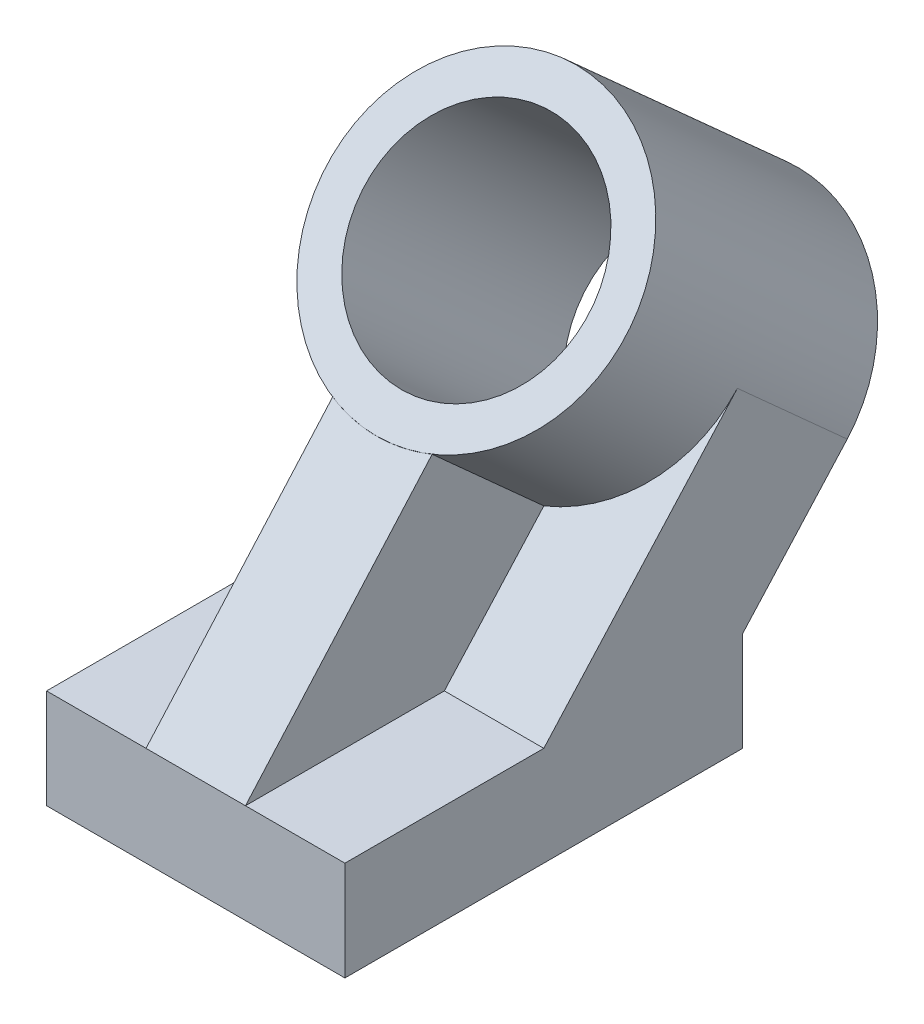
ISO-10303-21;
HEADER;
FILE_DESCRIPTION(('STEP AP214'),'2;1');
FILE_NAME('part.step','',(''),(''),'','','');
FILE_SCHEMA(('AUTOMOTIVE_DESIGN { 1 0 10303 214 1 1 1 1 }'));
ENDSEC;
DATA;
#1=APPLICATION_CONTEXT('core data for automotive mechanical design processes');
#2=APPLICATION_PROTOCOL_DEFINITION('international standard','automotive_design',2000,#1);
#3=PRODUCT_CONTEXT('',#1,'mechanical');
#4=PRODUCT('Part','Part','',(#3));
#5=PRODUCT_RELATED_PRODUCT_CATEGORY('part','',(#4));
#6=PRODUCT_DEFINITION_FORMATION('','',#4);
#7=PRODUCT_DEFINITION_CONTEXT('part definition',#1,'design');
#8=PRODUCT_DEFINITION('design','',#6,#7);
#9=PRODUCT_DEFINITION_SHAPE('','',#8);
#10=(LENGTH_UNIT() NAMED_UNIT(*) SI_UNIT(.MILLI.,.METRE.));
#11=(NAMED_UNIT(*) PLANE_ANGLE_UNIT() SI_UNIT($,.RADIAN.));
#12=(NAMED_UNIT(*) SI_UNIT($,.STERADIAN.) SOLID_ANGLE_UNIT());
#13=UNCERTAINTY_MEASURE_WITH_UNIT(LENGTH_MEASURE(1.E-05),#10,'distance_accuracy_value','');
#14=(GEOMETRIC_REPRESENTATION_CONTEXT(3) GLOBAL_UNCERTAINTY_ASSIGNED_CONTEXT((#13)) GLOBAL_UNIT_ASSIGNED_CONTEXT((#10,
#11,#12)) REPRESENTATION_CONTEXT('',''));
#15=CARTESIAN_POINT('',(0.,0.,0.));
#16=DIRECTION('',(0.,0.,1.));
#17=DIRECTION('',(1.,0.,0.));
#18=AXIS2_PLACEMENT_3D('',#15,#16,#17);
#19=CARTESIAN_POINT('',(38.1,25.4,-50.8));
#20=DIRECTION('',(0.,-0.669130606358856,-0.743144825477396));
#21=DIRECTION('',(0.,0.743144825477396,-0.669130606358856));
#22=AXIS2_PLACEMENT_3D('',#19,#20,#21);
#23=PLANE('',#22);
#24=DIRECTION('',(0.,0.743144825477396,-0.669130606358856));
#25=VECTOR('',#24,1.);
#26=CARTESIAN_POINT('',(12.7,25.4,-50.8));
#27=LINE('',#26,#25);
#28=CARTESIAN_POINT('',(12.7,25.4,-50.8));
#29=VERTEX_POINT('',#28);
#30=CARTESIAN_POINT('',(12.7,53.619218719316,-76.2086986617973));
#31=VERTEX_POINT('',#30);
#32=EDGE_CURVE('E48',#29,#31,#27,.T.);
#33=ORIENTED_EDGE('',*,*,#32,.F.);
#34=DIRECTION('',(-1.,0.,0.));
#35=VECTOR('',#34,1.);
#36=CARTESIAN_POINT('',(38.1,25.4,-50.8));
#37=LINE('',#36,#35);
#38=CARTESIAN_POINT('',(38.1,25.4,-50.8));
#39=VERTEX_POINT('',#38);
#40=EDGE_CURVE('E117',#39,#29,#37,.T.);
#41=ORIENTED_EDGE('',*,*,#40,.F.);
#42=DIRECTION('',(0.,-0.743144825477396,0.669130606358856));
#43=VECTOR('',#42,1.);
#44=CARTESIAN_POINT('',(38.1,25.4,-50.8));
#45=LINE('',#44,#43);
#46=CARTESIAN_POINT('',(38.1,80.313742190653,-100.244555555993));
#47=VERTEX_POINT('',#46);
#48=EDGE_CURVE('E103',#47,#39,#45,.T.);
#49=ORIENTED_EDGE('',*,*,#48,.F.);
#50=CARTESIAN_POINT('',(0.,80.313742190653,-100.244555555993));
#51=DIRECTION('',(0.,-0.669130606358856,-0.743144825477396));
#52=DIRECTION('',(0.,0.743144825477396,-0.669130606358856));
#53=AXIS2_PLACEMENT_3D('',#50,#51,#52);
#54=CIRCLE('',#53,38.1);
#55=EDGE_CURVE('E133',#47,#31,#54,.T.);
#56=ORIENTED_EDGE('',*,*,#55,.T.);
#57=EDGE_LOOP('',(#33,#41,#49,#56));
#58=FACE_BOUND('',#57,.T.);
#59=ADVANCED_FACE('F33',(#58),#23,.F.);
#60=CARTESIAN_POINT('',(38.1,25.4,0.));
#61=DIRECTION('',(0.,-1.,0.));
#62=DIRECTION('',(0.,0.,-1.));
#63=AXIS2_PLACEMENT_3D('',#60,#61,#62);
#64=PLANE('',#63);
#65=DIRECTION('',(0.,0.,-1.));
#66=VECTOR('',#65,1.);
#67=CARTESIAN_POINT('',(12.7,25.4,0.));
#68=LINE('',#67,#66);
#69=CARTESIAN_POINT('',(12.7,25.4,0.));
#70=VERTEX_POINT('',#69);
#71=EDGE_CURVE('E379',#70,#29,#68,.T.);
#72=ORIENTED_EDGE('',*,*,#71,.F.);
#73=DIRECTION('',(-1.,0.,0.));
#74=VECTOR('',#73,1.);
#75=CARTESIAN_POINT('',(38.1,25.4,0.));
#76=LINE('',#75,#74);
#77=CARTESIAN_POINT('',(38.1,25.4,0.));
#78=VERTEX_POINT('',#77);
#79=EDGE_CURVE('E125',#78,#70,#76,.T.);
#80=ORIENTED_EDGE('',*,*,#79,.F.);
#81=DIRECTION('',(0.,0.,1.));
#82=VECTOR('',#81,1.);
#83=CARTESIAN_POINT('',(38.1,25.4,0.));
#84=LINE('',#83,#82);
#85=EDGE_CURVE('E107',#39,#78,#84,.T.);
#86=ORIENTED_EDGE('',*,*,#85,.F.);
#87=ORIENTED_EDGE('',*,*,#40,.T.);
#88=EDGE_LOOP('',(#72,#80,#86,#87));
#89=FACE_BOUND('',#88,.T.);
#90=ADVANCED_FACE('F123',(#89),#64,.F.);
#91=CARTESIAN_POINT('',(38.1,0.,-101.6));
#92=DIRECTION('',(0.,1.,0.));
#93=DIRECTION('',(0.,0.,1.));
#94=AXIS2_PLACEMENT_3D('',#91,#92,#93);
#95=PLANE('',#94);
#96=DIRECTION('',(0.,0.,-1.));
#97=VECTOR('',#96,1.);
#98=CARTESIAN_POINT('',(-38.1,0.,-101.6));
#99=LINE('',#98,#97);
#100=CARTESIAN_POINT('',(-38.1,0.,0.));
#101=VERTEX_POINT('',#100);
#102=CARTESIAN_POINT('',(-38.1,0.,-101.6));
#103=VERTEX_POINT('',#102);
#104=EDGE_CURVE('E130',#101,#103,#99,.T.);
#105=ORIENTED_EDGE('',*,*,#104,.T.);
#106=DIRECTION('',(-1.,0.,0.));
#107=VECTOR('',#106,1.);
#108=CARTESIAN_POINT('',(38.1,0.,-101.6));
#109=LINE('',#108,#107);
#110=CARTESIAN_POINT('',(38.1,0.,-101.6));
#111=VERTEX_POINT('',#110);
#112=EDGE_CURVE('E11',#111,#103,#109,.T.);
#113=ORIENTED_EDGE('',*,*,#112,.F.);
#114=DIRECTION('',(0.,0.,-1.));
#115=VECTOR('',#114,1.);
#116=CARTESIAN_POINT('',(38.1,0.,-101.6));
#117=LINE('',#116,#115);
#118=CARTESIAN_POINT('',(38.1,0.,0.));
#119=VERTEX_POINT('',#118);
#120=EDGE_CURVE('E149',#119,#111,#117,.T.);
#121=ORIENTED_EDGE('',*,*,#120,.F.);
#122=DIRECTION('',(-1.,0.,0.));
#123=VECTOR('',#122,1.);
#124=CARTESIAN_POINT('',(38.1,0.,0.));
#125=LINE('',#124,#123);
#126=EDGE_CURVE('E83',#119,#101,#125,.T.);
#127=ORIENTED_EDGE('',*,*,#126,.T.);
#128=EDGE_LOOP('',(#105,#113,#121,#127));
#129=FACE_BOUND('',#128,.T.);
#130=ADVANCED_FACE('F35',(#129),#95,.F.);
#131=CARTESIAN_POINT('',(38.1,25.4,-101.6));
#132=DIRECTION('',(0.,0.,1.));
#133=DIRECTION('',(1.,0.,0.));
#134=AXIS2_PLACEMENT_3D('',#131,#132,#133);
#135=PLANE('',#134);
#136=DIRECTION('',(0.,1.,0.));
#137=VECTOR('',#136,1.);
#138=CARTESIAN_POINT('',(-38.1,25.4,-101.6));
#139=LINE('',#138,#137);
#140=CARTESIAN_POINT('',(-38.1,25.4,-101.6));
#141=VERTEX_POINT('',#140);
#142=EDGE_CURVE('E132',#103,#141,#139,.T.);
#143=ORIENTED_EDGE('',*,*,#142,.T.);
#144=DIRECTION('',(-1.,0.,0.));
#145=VECTOR('',#144,1.);
#146=CARTESIAN_POINT('',(38.1,25.4,-101.6));
#147=LINE('',#146,#145);
#148=CARTESIAN_POINT('',(38.1,25.4,-101.6));
#149=VERTEX_POINT('',#148);
#150=EDGE_CURVE('E41',#149,#141,#147,.T.);
#151=ORIENTED_EDGE('',*,*,#150,.F.);
#152=DIRECTION('',(0.,1.,0.));
#153=VECTOR('',#152,1.);
#154=CARTESIAN_POINT('',(38.1,25.4,-101.6));
#155=LINE('',#154,#153);
#156=EDGE_CURVE('E91',#111,#149,#155,.T.);
#157=ORIENTED_EDGE('',*,*,#156,.F.);
#158=ORIENTED_EDGE('',*,*,#112,.T.);
#159=EDGE_LOOP('',(#143,#151,#157,#158));
#160=FACE_BOUND('',#159,.T.);
#161=ADVANCED_FACE('F159',(#160),#135,.F.);
#162=CARTESIAN_POINT('',(38.1,55.0528860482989,-128.299578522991));
#163=DIRECTION('',(0.,0.669130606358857,0.743144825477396));
#164=DIRECTION('',(0.,-0.743144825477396,0.669130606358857));
#165=AXIS2_PLACEMENT_3D('',#162,#163,#164);
#166=PLANE('',#165);
#167=CARTESIAN_POINT('',(0.,55.0528860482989,-128.299578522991));
#168=DIRECTION('',(0.,0.669130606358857,0.743144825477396));
#169=DIRECTION('',(0.,-0.743144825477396,0.669130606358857));
#170=AXIS2_PLACEMENT_3D('',#167,#168,#169);
#171=CIRCLE('',#170,28.575);
#172=CARTESIAN_POINT('',(0.,33.8175226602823,-109.179171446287));
#173=VERTEX_POINT('',#172);
#174=EDGE_CURVE('E172',#173,#173,#171,.T.);
#175=ORIENTED_EDGE('',*,*,#174,.T.);
#176=EDGE_LOOP('',(#175));
#177=FACE_BOUND('',#176,.T.);
#178=CARTESIAN_POINT('',(0.,55.0528860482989,-128.299578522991));
#179=DIRECTION('',(0.,-0.669130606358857,-0.743144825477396));
#180=DIRECTION('',(0.,0.743144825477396,-0.669130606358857));
#181=AXIS2_PLACEMENT_3D('',#178,#179,#180);
#182=CIRCLE('',#181,38.1);
#183=CARTESIAN_POINT('',(-38.1,55.0528860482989,-128.299578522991));
#184=VERTEX_POINT('',#183);
#185=CARTESIAN_POINT('',(38.1,55.0528860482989,-128.299578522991));
#186=VERTEX_POINT('',#185);
#187=EDGE_CURVE('E169',#184,#186,#182,.T.);
#188=ORIENTED_EDGE('',*,*,#187,.T.);
#189=DIRECTION('',(0.,0.743144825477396,-0.669130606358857));
#190=VECTOR('',#189,1.);
#191=CARTESIAN_POINT('',(38.1,55.0528860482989,-128.299578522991));
#192=LINE('',#191,#190);
#193=EDGE_CURVE('E157',#149,#186,#192,.T.);
#194=ORIENTED_EDGE('',*,*,#193,.F.);
#195=ORIENTED_EDGE('',*,*,#150,.T.);
#196=DIRECTION('',(0.,0.743144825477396,-0.669130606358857));
#197=VECTOR('',#196,1.);
#198=CARTESIAN_POINT('',(-38.1,55.0528860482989,-128.299578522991));
#199=LINE('',#198,#197);
#200=EDGE_CURVE('E136',#141,#184,#199,.T.);
#201=ORIENTED_EDGE('',*,*,#200,.T.);
#202=EDGE_LOOP('',(#188,#194,#195,#201));
#203=FACE_BOUND('',#202,.T.);
#204=ADVANCED_FACE('F154',(#177,#203),#166,.F.);
#205=CARTESIAN_POINT('',(-12.7,25.4,-50.8));
#206=VERTEX_POINT('',#205);
#207=CARTESIAN_POINT('',(-38.1,25.4,-50.8));
#208=VERTEX_POINT('',#207);
#209=EDGE_CURVE('E121',#206,#208,#37,.T.);
#210=ORIENTED_EDGE('',*,*,#209,.F.);
#211=DIRECTION('',(0.,0.743144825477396,-0.669130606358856));
#212=VECTOR('',#211,1.);
#213=CARTESIAN_POINT('',(-12.7,25.4,-50.8));
#214=LINE('',#213,#212);
#215=CARTESIAN_POINT('',(-12.7,53.619218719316,-76.2086986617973));
#216=VERTEX_POINT('',#215);
#217=EDGE_CURVE('E205',#206,#216,#214,.T.);
#218=ORIENTED_EDGE('',*,*,#217,.T.);
#219=CARTESIAN_POINT('',(-38.1,80.313742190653,-100.244555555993));
#220=VERTEX_POINT('',#219);
#221=EDGE_CURVE('E175',#216,#220,#54,.T.);
#222=ORIENTED_EDGE('',*,*,#221,.T.);
#223=DIRECTION('',(0.,-0.743144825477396,0.669130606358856));
#224=VECTOR('',#223,1.);
#225=CARTESIAN_POINT('',(-38.1,25.4,-50.8));
#226=LINE('',#225,#224);
#227=EDGE_CURVE('E141',#220,#208,#226,.T.);
#228=ORIENTED_EDGE('',*,*,#227,.T.);
#229=EDGE_LOOP('',(#210,#218,#222,#228));
#230=FACE_BOUND('',#229,.T.);
#231=ADVANCED_FACE('F202',(#230),#23,.F.);
#232=CARTESIAN_POINT('',(-12.7,25.4,0.));
#233=VERTEX_POINT('',#232);
#234=CARTESIAN_POINT('',(-38.1,25.4,0.));
#235=VERTEX_POINT('',#234);
#236=EDGE_CURVE('E151',#233,#235,#76,.T.);
#237=ORIENTED_EDGE('',*,*,#236,.F.);
#238=DIRECTION('',(0.,0.,-1.));
#239=VECTOR('',#238,1.);
#240=CARTESIAN_POINT('',(-12.7,25.4,0.));
#241=LINE('',#240,#239);
#242=EDGE_CURVE('E198',#233,#206,#241,.T.);
#243=ORIENTED_EDGE('',*,*,#242,.T.);
#244=ORIENTED_EDGE('',*,*,#209,.T.);
#245=DIRECTION('',(0.,0.,1.));
#246=VECTOR('',#245,1.);
#247=CARTESIAN_POINT('',(-38.1,25.4,0.));
#248=LINE('',#247,#246);
#249=EDGE_CURVE('E144',#208,#235,#248,.T.);
#250=ORIENTED_EDGE('',*,*,#249,.T.);
#251=EDGE_LOOP('',(#237,#243,#244,#250));
#252=FACE_BOUND('',#251,.T.);
#253=ADVANCED_FACE('F194',(#252),#64,.F.);
#254=CARTESIAN_POINT('',(38.1,0.,0.));
#255=DIRECTION('',(0.,0.,-1.));
#256=DIRECTION('',(-1.,0.,0.));
#257=AXIS2_PLACEMENT_3D('',#254,#255,#256);
#258=PLANE('',#257);
#259=DIRECTION('',(0.,-1.,0.));
#260=VECTOR('',#259,1.);
#261=CARTESIAN_POINT('',(-38.1,0.,0.));
#262=LINE('',#261,#260);
#263=EDGE_CURVE('E147',#235,#101,#262,.T.);
#264=ORIENTED_EDGE('',*,*,#263,.T.);
#265=ORIENTED_EDGE('',*,*,#126,.F.);
#266=DIRECTION('',(0.,-1.,0.));
#267=VECTOR('',#266,1.);
#268=CARTESIAN_POINT('',(38.1,0.,0.));
#269=LINE('',#268,#267);
#270=EDGE_CURVE('E57',#78,#119,#269,.T.);
#271=ORIENTED_EDGE('',*,*,#270,.F.);
#272=ORIENTED_EDGE('',*,*,#79,.T.);
#273=DIRECTION('',(-1.,0.,0.));
#274=VECTOR('',#273,1.);
#275=CARTESIAN_POINT('',(38.1,25.4,0.));
#276=LINE('',#275,#274);
#277=EDGE_CURVE('E191',#233,#70,#276,.F.);
#278=ORIENTED_EDGE('',*,*,#277,.F.);
#279=ORIENTED_EDGE('',*,*,#236,.T.);
#280=EDGE_LOOP('',(#264,#265,#271,#272,#278,#279));
#281=FACE_BOUND('',#280,.T.);
#282=ADVANCED_FACE('F186',(#281),#258,.F.);
#283=CARTESIAN_POINT('',(38.1,0.,0.));
#284=DIRECTION('',(-1.,0.,0.));
#285=DIRECTION('',(0.,0.,1.));
#286=AXIS2_PLACEMENT_3D('',#283,#284,#285);
#287=PLANE('',#286);
#288=ORIENTED_EDGE('',*,*,#120,.T.);
#289=ORIENTED_EDGE('',*,*,#156,.T.);
#290=ORIENTED_EDGE('',*,*,#193,.T.);
#291=DIRECTION('',(0.,0.669130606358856,0.743144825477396));
#292=VECTOR('',#291,1.);
#293=CARTESIAN_POINT('',(38.1,80.313742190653,-100.244555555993));
#294=LINE('',#293,#292);
#295=EDGE_CURVE('E111',#186,#47,#294,.T.);
#296=ORIENTED_EDGE('',*,*,#295,.T.);
#297=ORIENTED_EDGE('',*,*,#48,.T.);
#298=ORIENTED_EDGE('',*,*,#85,.T.);
#299=ORIENTED_EDGE('',*,*,#270,.T.);
#300=EDGE_LOOP('',(#288,#289,#290,#296,#297,#298,#299));
#301=FACE_BOUND('',#300,.T.);
#302=ADVANCED_FACE('F105',(#301),#287,.F.);
#303=CARTESIAN_POINT('',(-38.1,0.,0.));
#304=DIRECTION('',(-1.,0.,0.));
#305=DIRECTION('',(0.,0.,1.));
#306=AXIS2_PLACEMENT_3D('',#303,#304,#305);
#307=PLANE('',#306);
#308=ORIENTED_EDGE('',*,*,#104,.F.);
#309=ORIENTED_EDGE('',*,*,#263,.F.);
#310=ORIENTED_EDGE('',*,*,#249,.F.);
#311=ORIENTED_EDGE('',*,*,#227,.F.);
#312=DIRECTION('',(0.,0.669130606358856,0.743144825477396));
#313=VECTOR('',#312,1.);
#314=CARTESIAN_POINT('',(-38.1,80.313742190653,-100.244555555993));
#315=LINE('',#314,#313);
#316=EDGE_CURVE('E138',#184,#220,#315,.T.);
#317=ORIENTED_EDGE('',*,*,#316,.F.);
#318=ORIENTED_EDGE('',*,*,#200,.F.);
#319=ORIENTED_EDGE('',*,*,#142,.F.);
#320=EDGE_LOOP('',(#308,#309,#310,#311,#317,#318,#319));
#321=FACE_BOUND('',#320,.T.);
#322=ADVANCED_FACE('F163',(#321),#307,.T.);
#323=CARTESIAN_POINT('',(0.,106.040638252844,-71.6719428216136));
#324=DIRECTION('',(0.,-0.669130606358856,-0.743144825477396));
#325=DIRECTION('',(0.,0.743144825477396,-0.669130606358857));
#326=AXIS2_PLACEMENT_3D('',#323,#324,#325);
#327=CYLINDRICAL_SURFACE('',#326,38.1);
#328=CARTESIAN_POINT('',(0.,106.040638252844,-71.6719428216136));
#329=DIRECTION('',(0.,-0.669130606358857,-0.743144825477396));
#330=DIRECTION('',(0.,0.743144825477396,-0.669130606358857));
#331=AXIS2_PLACEMENT_3D('',#328,#329,#330);
#332=CIRCLE('',#331,38.1);
#333=CARTESIAN_POINT('',(0.,134.354456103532,-97.1658189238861));
#334=VERTEX_POINT('',#333);
#335=EDGE_CURVE('E171',#334,#334,#332,.T.);
#336=ORIENTED_EDGE('',*,*,#335,.T.);
#337=EDGE_LOOP('',(#336));
#338=FACE_BOUND('',#337,.T.);
#339=ORIENTED_EDGE('',*,*,#295,.F.);
#340=ORIENTED_EDGE('',*,*,#187,.F.);
#341=ORIENTED_EDGE('',*,*,#316,.T.);
#342=ORIENTED_EDGE('',*,*,#221,.F.);
#343=DIRECTION('',(0.,-0.669130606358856,-0.743144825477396));
#344=VECTOR('',#343,1.);
#345=CARTESIAN_POINT('',(-12.7,79.3461147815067,-47.6360859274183));
#346=LINE('',#345,#344);
#347=CARTESIAN_POINT('',(-12.7,79.3029485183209,-47.6840269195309));
#348=VERTEX_POINT('',#347);
#349=EDGE_CURVE('E210',#348,#216,#346,.T.);
#350=ORIENTED_EDGE('',*,*,#349,.F.);
#351=CARTESIAN_POINT('',(0.,106.2085489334,-71.4854591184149));
#352=DIRECTION('',(0.,-0.662578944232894,-0.748992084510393));
#353=DIRECTION('',(0.,-0.748992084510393,0.662578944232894));
#354=AXIS2_PLACEMENT_3D('',#351,#352,#353);
#355=ELLIPSE('',#354,38.1014690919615,38.1);
#356=CARTESIAN_POINT('',(12.7,79.3029485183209,-47.6840269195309));
#357=VERTEX_POINT('',#356);
#358=EDGE_CURVE('E231',#357,#348,#355,.T.);
#359=ORIENTED_EDGE('',*,*,#358,.F.);
#360=DIRECTION('',(0.,-0.669130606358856,-0.743144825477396));
#361=VECTOR('',#360,1.);
#362=CARTESIAN_POINT('',(12.7,79.3461147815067,-47.6360859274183));
#363=LINE('',#362,#361);
#364=EDGE_CURVE('E223',#357,#31,#363,.T.);
#365=ORIENTED_EDGE('',*,*,#364,.T.);
#366=ORIENTED_EDGE('',*,*,#55,.F.);
#367=EDGE_LOOP('',(#339,#340,#341,#342,#350,#359,#365,#366));
#368=FACE_BOUND('',#367,.T.);
#369=ADVANCED_FACE('F170',(#338,#368),#327,.T.);
#370=CARTESIAN_POINT('',(0.,106.040638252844,-71.6719428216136));
#371=DIRECTION('',(0.,-0.669130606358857,-0.743144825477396));
#372=DIRECTION('',(0.,0.743144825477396,-0.669130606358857));
#373=AXIS2_PLACEMENT_3D('',#370,#371,#372);
#374=PLANE('',#373);
#375=CARTESIAN_POINT('',(0.,106.040638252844,-71.6719428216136));
#376=DIRECTION('',(0.,0.669130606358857,0.743144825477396));
#377=DIRECTION('',(0.,-0.743144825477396,0.669130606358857));
#378=AXIS2_PLACEMENT_3D('',#375,#376,#377);
#379=CIRCLE('',#378,28.575);
#380=CARTESIAN_POINT('',(0.,84.8052748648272,-52.5515357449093));
#381=VERTEX_POINT('',#380);
#382=EDGE_CURVE('E178',#381,#381,#379,.T.);
#383=ORIENTED_EDGE('',*,*,#382,.F.);
#384=EDGE_LOOP('',(#383));
#385=FACE_BOUND('',#384,.T.);
#386=ORIENTED_EDGE('',*,*,#335,.F.);
#387=EDGE_LOOP('',(#386));
#388=FACE_BOUND('',#387,.T.);
#389=ADVANCED_FACE('F244',(#385,#388),#374,.F.);
#390=CARTESIAN_POINT('',(0.,17.7266308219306,-169.754584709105));
#391=DIRECTION('',(0.,0.669130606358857,0.743144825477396));
#392=DIRECTION('',(0.,-0.743144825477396,0.669130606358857));
#393=AXIS2_PLACEMENT_3D('',#390,#391,#392);
#394=CYLINDRICAL_SURFACE('',#393,28.575);
#395=ORIENTED_EDGE('',*,*,#174,.F.);
#396=EDGE_LOOP('',(#395));
#397=FACE_BOUND('',#396,.T.);
#398=ORIENTED_EDGE('',*,*,#382,.T.);
#399=EDGE_LOOP('',(#398));
#400=FACE_BOUND('',#399,.T.);
#401=ADVANCED_FACE('F242',(#397,#400),#394,.F.);
#402=CARTESIAN_POINT('',(-12.7,67.1772280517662,-76.8967273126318));
#403=DIRECTION('',(-1.,0.,0.));
#404=DIRECTION('',(0.,0.,1.));
#405=AXIS2_PLACEMENT_3D('',#402,#403,#404);
#406=PLANE('',#405);
#407=DIRECTION('',(0.,-0.748992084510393,0.662578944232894));
#408=VECTOR('',#407,1.);
#409=CARTESIAN_POINT('',(-12.7,84.8052748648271,-52.5515357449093));
#410=LINE('',#409,#408);
#411=EDGE_CURVE('E232',#348,#233,#410,.T.);
#412=ORIENTED_EDGE('',*,*,#411,.F.);
#413=ORIENTED_EDGE('',*,*,#349,.T.);
#414=ORIENTED_EDGE('',*,*,#217,.F.);
#415=ORIENTED_EDGE('',*,*,#242,.F.);
#416=EDGE_LOOP('',(#412,#413,#414,#415));
#417=FACE_BOUND('',#416,.T.);
#418=ADVANCED_FACE('F276',(#417),#406,.T.);
#419=CARTESIAN_POINT('',(12.7,67.1772280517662,-76.8967273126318));
#420=DIRECTION('',(-1.,0.,0.));
#421=DIRECTION('',(0.,0.,1.));
#422=AXIS2_PLACEMENT_3D('',#419,#420,#421);
#423=PLANE('',#422);
#424=ORIENTED_EDGE('',*,*,#364,.F.);
#425=DIRECTION('',(0.,-0.748992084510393,0.662578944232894));
#426=VECTOR('',#425,1.);
#427=CARTESIAN_POINT('',(12.7,84.8052748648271,-52.5515357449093));
#428=LINE('',#427,#426);
#429=EDGE_CURVE('E226',#357,#70,#428,.T.);
#430=ORIENTED_EDGE('',*,*,#429,.T.);
#431=ORIENTED_EDGE('',*,*,#71,.T.);
#432=ORIENTED_EDGE('',*,*,#32,.T.);
#433=EDGE_LOOP('',(#424,#430,#431,#432));
#434=FACE_BOUND('',#433,.T.);
#435=ADVANCED_FACE('F225',(#434),#423,.F.);
#436=CARTESIAN_POINT('',(0.,84.8052748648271,-52.5515357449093));
#437=DIRECTION('',(0.,-0.662578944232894,-0.748992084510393));
#438=DIRECTION('',(0.,-0.748992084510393,0.662578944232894));
#439=AXIS2_PLACEMENT_3D('',#436,#437,#438);
#440=PLANE('',#439);
#441=ORIENTED_EDGE('',*,*,#411,.T.);
#442=ORIENTED_EDGE('',*,*,#277,.T.);
#443=ORIENTED_EDGE('',*,*,#429,.F.);
#444=ORIENTED_EDGE('',*,*,#358,.T.);
#445=EDGE_LOOP('',(#441,#442,#443,#444));
#446=FACE_BOUND('',#445,.T.);
#447=ADVANCED_FACE('F230',(#446),#440,.F.);
#448=CLOSED_SHELL('',(#59,#90,#130,#161,#204,#231,#253,#282,#302,#322,#369,#389,#401,#418,#435,#447));
#449=MANIFOLD_SOLID_BREP('B2',#448);
#450=ADVANCED_BREP_SHAPE_REPRESENTATION('',(#18,#449),#14);
#451=SHAPE_DEFINITION_REPRESENTATION(#9,#450);
ENDSEC;
END-ISO-10303-21;
